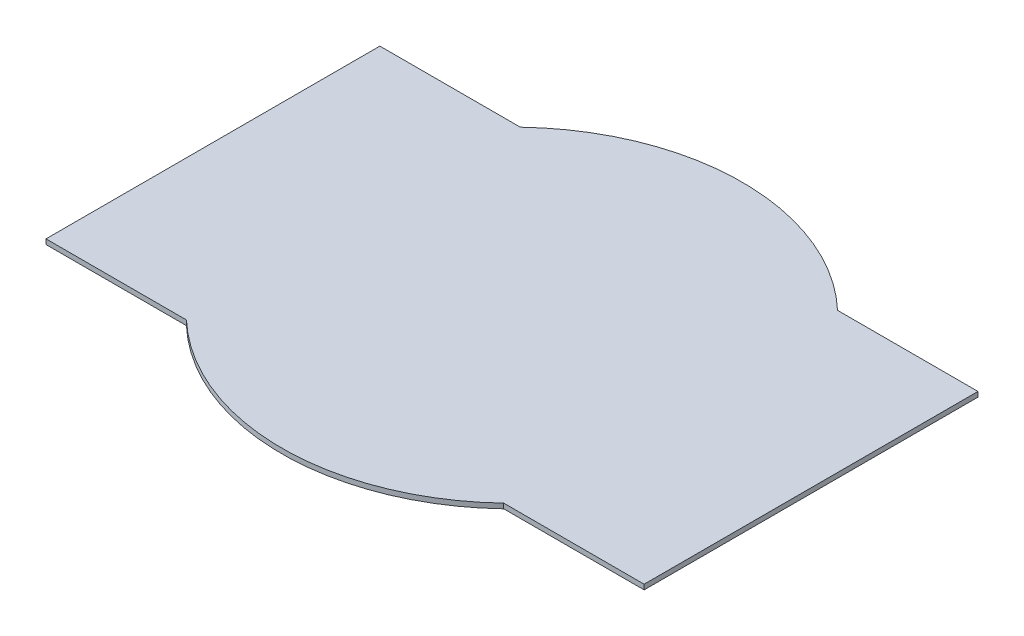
ISO-10303-21;
HEADER;
FILE_DESCRIPTION(('STEP AP214'),'2;1');
FILE_NAME('part.step','',(''),(''),'','','');
FILE_SCHEMA(('AUTOMOTIVE_DESIGN { 1 0 10303 214 1 1 1 1 }'));
ENDSEC;
DATA;
#1=APPLICATION_CONTEXT('core data for automotive mechanical design processes');
#2=APPLICATION_PROTOCOL_DEFINITION('international standard','automotive_design',2000,#1);
#3=PRODUCT_CONTEXT('',#1,'mechanical');
#4=PRODUCT('Part','Part','',(#3));
#5=PRODUCT_RELATED_PRODUCT_CATEGORY('part','',(#4));
#6=PRODUCT_DEFINITION_FORMATION('','',#4);
#7=PRODUCT_DEFINITION_CONTEXT('part definition',#1,'design');
#8=PRODUCT_DEFINITION('design','',#6,#7);
#9=PRODUCT_DEFINITION_SHAPE('','',#8);
#10=(LENGTH_UNIT() NAMED_UNIT(*) SI_UNIT(.MILLI.,.METRE.));
#11=(NAMED_UNIT(*) PLANE_ANGLE_UNIT() SI_UNIT($,.RADIAN.));
#12=(NAMED_UNIT(*) SI_UNIT($,.STERADIAN.) SOLID_ANGLE_UNIT());
#13=UNCERTAINTY_MEASURE_WITH_UNIT(LENGTH_MEASURE(1.E-05),#10,'distance_accuracy_value','');
#14=(GEOMETRIC_REPRESENTATION_CONTEXT(3) GLOBAL_UNCERTAINTY_ASSIGNED_CONTEXT((#13)) GLOBAL_UNIT_ASSIGNED_CONTEXT((#10,
#11,#12)) REPRESENTATION_CONTEXT('',''));
#15=CARTESIAN_POINT('',(0.,0.,0.));
#16=DIRECTION('',(0.,0.,1.));
#17=DIRECTION('',(1.,0.,0.));
#18=AXIS2_PLACEMENT_3D('',#15,#16,#17);
#19=CARTESIAN_POINT('',(-76.545039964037,1.27,-42.7256119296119));
#20=DIRECTION('',(1.,0.,0.));
#21=DIRECTION('',(0.,0.,-1.));
#22=AXIS2_PLACEMENT_3D('',#19,#20,#21);
#23=PLANE('',#22);
#24=DIRECTION('',(0.,0.,1.));
#25=VECTOR('',#24,1.);
#26=CARTESIAN_POINT('',(-76.545039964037,0.,-42.7256119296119));
#27=LINE('',#26,#25);
#28=CARTESIAN_POINT('',(-76.545039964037,0.,-42.7256119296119));
#29=VERTEX_POINT('',#28);
#30=CARTESIAN_POINT('',(-76.545039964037,0.,42.7256119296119));
#31=VERTEX_POINT('',#30);
#32=EDGE_CURVE('E96',#29,#31,#27,.T.);
#33=ORIENTED_EDGE('',*,*,#32,.T.);
#34=DIRECTION('',(0.,-1.,0.));
#35=VECTOR('',#34,1.);
#36=CARTESIAN_POINT('',(-76.545039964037,1.27,42.7256119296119));
#37=LINE('',#36,#35);
#38=CARTESIAN_POINT('',(-76.545039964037,1.27,42.7256119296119));
#39=VERTEX_POINT('',#38);
#40=EDGE_CURVE('E11',#39,#31,#37,.T.);
#41=ORIENTED_EDGE('',*,*,#40,.F.);
#42=DIRECTION('',(0.,0.,1.));
#43=VECTOR('',#42,1.);
#44=CARTESIAN_POINT('',(-76.545039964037,1.27,-42.7256119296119));
#45=LINE('',#44,#43);
#46=CARTESIAN_POINT('',(-76.545039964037,1.27,-42.7256119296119));
#47=VERTEX_POINT('',#46);
#48=EDGE_CURVE('E123',#47,#39,#45,.T.);
#49=ORIENTED_EDGE('',*,*,#48,.F.);
#50=DIRECTION('',(0.,-1.,0.));
#51=VECTOR('',#50,1.);
#52=CARTESIAN_POINT('',(-76.545039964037,1.27,-42.7256119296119));
#53=LINE('',#52,#51);
#54=EDGE_CURVE('E109',#47,#29,#53,.T.);
#55=ORIENTED_EDGE('',*,*,#54,.T.);
#56=EDGE_LOOP('',(#33,#41,#49,#55));
#57=FACE_BOUND('',#56,.T.);
#58=ADVANCED_FACE('F28',(#57),#23,.F.);
#59=CARTESIAN_POINT('',(-76.545039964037,1.27,42.7256119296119));
#60=DIRECTION('',(0.,0.,-1.));
#61=DIRECTION('',(-1.,0.,0.));
#62=AXIS2_PLACEMENT_3D('',#59,#60,#61);
#63=PLANE('',#62);
#64=DIRECTION('',(1.,0.,0.));
#65=VECTOR('',#64,1.);
#66=CARTESIAN_POINT('',(-76.545039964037,0.,42.7256119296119));
#67=LINE('',#66,#65);
#68=CARTESIAN_POINT('',(-40.6037432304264,0.,42.7256119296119));
#69=VERTEX_POINT('',#68);
#70=EDGE_CURVE('E92',#31,#69,#67,.T.);
#71=ORIENTED_EDGE('',*,*,#70,.T.);
#72=DIRECTION('',(0.,-1.,0.));
#73=VECTOR('',#72,1.);
#74=CARTESIAN_POINT('',(-40.6037432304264,1.27,42.7256119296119));
#75=LINE('',#74,#73);
#76=CARTESIAN_POINT('',(-40.6037432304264,1.27,42.7256119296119));
#77=VERTEX_POINT('',#76);
#78=EDGE_CURVE('E35',#77,#69,#75,.T.);
#79=ORIENTED_EDGE('',*,*,#78,.F.);
#80=DIRECTION('',(1.,0.,0.));
#81=VECTOR('',#80,1.);
#82=CARTESIAN_POINT('',(-76.545039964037,1.27,42.7256119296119));
#83=LINE('',#82,#81);
#84=EDGE_CURVE('E105',#39,#77,#83,.T.);
#85=ORIENTED_EDGE('',*,*,#84,.F.);
#86=ORIENTED_EDGE('',*,*,#40,.T.);
#87=EDGE_LOOP('',(#71,#79,#85,#86));
#88=FACE_BOUND('',#87,.T.);
#89=ADVANCED_FACE('F104',(#88),#63,.F.);
#90=CARTESIAN_POINT('',(0.,1.27,0.));
#91=DIRECTION('',(0.,-1.,0.));
#92=DIRECTION('',(0.,0.,-1.));
#93=AXIS2_PLACEMENT_3D('',#90,#91,#92);
#94=CYLINDRICAL_SURFACE('',#93,58.9418516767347);
#95=CARTESIAN_POINT('',(0.,0.,0.));
#96=DIRECTION('',(0.,1.,0.));
#97=DIRECTION('',(0.,0.,1.));
#98=AXIS2_PLACEMENT_3D('',#95,#96,#97);
#99=CIRCLE('',#98,58.9418516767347);
#100=CARTESIAN_POINT('',(40.6037432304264,0.,42.7256119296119));
#101=VERTEX_POINT('',#100);
#102=EDGE_CURVE('E98',#69,#101,#99,.T.);
#103=ORIENTED_EDGE('',*,*,#102,.T.);
#104=DIRECTION('',(0.,-1.,0.));
#105=VECTOR('',#104,1.);
#106=CARTESIAN_POINT('',(40.6037432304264,1.27,42.7256119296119));
#107=LINE('',#106,#105);
#108=CARTESIAN_POINT('',(40.6037432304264,1.27,42.7256119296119));
#109=VERTEX_POINT('',#108);
#110=EDGE_CURVE('E149',#109,#101,#107,.T.);
#111=ORIENTED_EDGE('',*,*,#110,.F.);
#112=CARTESIAN_POINT('',(0.,1.27,0.));
#113=DIRECTION('',(0.,1.,0.));
#114=DIRECTION('',(0.,0.,1.));
#115=AXIS2_PLACEMENT_3D('',#112,#113,#114);
#116=CIRCLE('',#115,58.9418516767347);
#117=EDGE_CURVE('E126',#77,#109,#116,.T.);
#118=ORIENTED_EDGE('',*,*,#117,.F.);
#119=ORIENTED_EDGE('',*,*,#78,.T.);
#120=EDGE_LOOP('',(#103,#111,#118,#119));
#121=FACE_BOUND('',#120,.T.);
#122=ADVANCED_FACE('F153',(#121),#94,.T.);
#123=CARTESIAN_POINT('',(40.6037432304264,1.27,42.7256119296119));
#124=DIRECTION('',(0.,0.,-1.));
#125=DIRECTION('',(-1.,0.,0.));
#126=AXIS2_PLACEMENT_3D('',#123,#124,#125);
#127=PLANE('',#126);
#128=DIRECTION('',(1.,0.,0.));
#129=VECTOR('',#128,1.);
#130=CARTESIAN_POINT('',(40.6037432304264,0.,42.7256119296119));
#131=LINE('',#130,#129);
#132=CARTESIAN_POINT('',(76.545039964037,0.,42.7256119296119));
#133=VERTEX_POINT('',#132);
#134=EDGE_CURVE('E113',#101,#133,#131,.T.);
#135=ORIENTED_EDGE('',*,*,#134,.T.);
#136=DIRECTION('',(0.,-1.,0.));
#137=VECTOR('',#136,1.);
#138=CARTESIAN_POINT('',(76.545039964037,1.27,42.7256119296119));
#139=LINE('',#138,#137);
#140=CARTESIAN_POINT('',(76.545039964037,1.27,42.7256119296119));
#141=VERTEX_POINT('',#140);
#142=EDGE_CURVE('E146',#141,#133,#139,.T.);
#143=ORIENTED_EDGE('',*,*,#142,.F.);
#144=DIRECTION('',(1.,0.,0.));
#145=VECTOR('',#144,1.);
#146=CARTESIAN_POINT('',(40.6037432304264,1.27,42.7256119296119));
#147=LINE('',#146,#145);
#148=EDGE_CURVE('E128',#109,#141,#147,.T.);
#149=ORIENTED_EDGE('',*,*,#148,.F.);
#150=ORIENTED_EDGE('',*,*,#110,.T.);
#151=EDGE_LOOP('',(#135,#143,#149,#150));
#152=FACE_BOUND('',#151,.T.);
#153=ADVANCED_FACE('F161',(#152),#127,.F.);
#154=CARTESIAN_POINT('',(76.545039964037,1.27,-42.7256119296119));
#155=DIRECTION('',(-1.,0.,0.));
#156=DIRECTION('',(0.,0.,1.));
#157=AXIS2_PLACEMENT_3D('',#154,#155,#156);
#158=PLANE('',#157);
#159=DIRECTION('',(0.,0.,-1.));
#160=VECTOR('',#159,1.);
#161=CARTESIAN_POINT('',(76.545039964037,0.,-42.7256119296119));
#162=LINE('',#161,#160);
#163=CARTESIAN_POINT('',(76.545039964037,0.,-42.7256119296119));
#164=VERTEX_POINT('',#163);
#165=EDGE_CURVE('E115',#133,#164,#162,.T.);
#166=ORIENTED_EDGE('',*,*,#165,.T.);
#167=DIRECTION('',(0.,-1.,0.));
#168=VECTOR('',#167,1.);
#169=CARTESIAN_POINT('',(76.545039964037,1.27,-42.7256119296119));
#170=LINE('',#169,#168);
#171=CARTESIAN_POINT('',(76.545039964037,1.27,-42.7256119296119));
#172=VERTEX_POINT('',#171);
#173=EDGE_CURVE('E143',#172,#164,#170,.T.);
#174=ORIENTED_EDGE('',*,*,#173,.F.);
#175=DIRECTION('',(0.,0.,-1.));
#176=VECTOR('',#175,1.);
#177=CARTESIAN_POINT('',(76.545039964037,1.27,-42.7256119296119));
#178=LINE('',#177,#176);
#179=EDGE_CURVE('E130',#141,#172,#178,.T.);
#180=ORIENTED_EDGE('',*,*,#179,.F.);
#181=ORIENTED_EDGE('',*,*,#142,.T.);
#182=EDGE_LOOP('',(#166,#174,#180,#181));
#183=FACE_BOUND('',#182,.T.);
#184=ADVANCED_FACE('F164',(#183),#158,.F.);
#185=CARTESIAN_POINT('',(40.6037432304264,1.27,-42.7256119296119));
#186=DIRECTION('',(0.,0.,1.));
#187=DIRECTION('',(1.,0.,0.));
#188=AXIS2_PLACEMENT_3D('',#185,#186,#187);
#189=PLANE('',#188);
#190=DIRECTION('',(-1.,0.,0.));
#191=VECTOR('',#190,1.);
#192=CARTESIAN_POINT('',(40.6037432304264,0.,-42.7256119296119));
#193=LINE('',#192,#191);
#194=CARTESIAN_POINT('',(40.6037432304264,0.,-42.7256119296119));
#195=VERTEX_POINT('',#194);
#196=EDGE_CURVE('E117',#164,#195,#193,.T.);
#197=ORIENTED_EDGE('',*,*,#196,.T.);
#198=DIRECTION('',(0.,-1.,0.));
#199=VECTOR('',#198,1.);
#200=CARTESIAN_POINT('',(40.6037432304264,1.27,-42.7256119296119));
#201=LINE('',#200,#199);
#202=CARTESIAN_POINT('',(40.6037432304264,1.27,-42.7256119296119));
#203=VERTEX_POINT('',#202);
#204=EDGE_CURVE('E140',#203,#195,#201,.T.);
#205=ORIENTED_EDGE('',*,*,#204,.F.);
#206=DIRECTION('',(-1.,0.,0.));
#207=VECTOR('',#206,1.);
#208=CARTESIAN_POINT('',(40.6037432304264,1.27,-42.7256119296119));
#209=LINE('',#208,#207);
#210=EDGE_CURVE('E132',#172,#203,#209,.T.);
#211=ORIENTED_EDGE('',*,*,#210,.F.);
#212=ORIENTED_EDGE('',*,*,#173,.T.);
#213=EDGE_LOOP('',(#197,#205,#211,#212));
#214=FACE_BOUND('',#213,.T.);
#215=ADVANCED_FACE('F169',(#214),#189,.F.);
#216=CARTESIAN_POINT('',(0.,1.27,0.));
#217=DIRECTION('',(0.,-1.,0.));
#218=DIRECTION('',(0.,0.,-1.));
#219=AXIS2_PLACEMENT_3D('',#216,#217,#218);
#220=CYLINDRICAL_SURFACE('',#219,58.9418516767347);
#221=CARTESIAN_POINT('',(0.,0.,0.));
#222=DIRECTION('',(0.,1.,0.));
#223=DIRECTION('',(0.,0.,1.));
#224=AXIS2_PLACEMENT_3D('',#221,#222,#223);
#225=CIRCLE('',#224,58.9418516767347);
#226=CARTESIAN_POINT('',(-40.6037432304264,0.,-42.7256119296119));
#227=VERTEX_POINT('',#226);
#228=EDGE_CURVE('E119',#195,#227,#225,.T.);
#229=ORIENTED_EDGE('',*,*,#228,.T.);
#230=DIRECTION('',(0.,-1.,0.));
#231=VECTOR('',#230,1.);
#232=CARTESIAN_POINT('',(-40.6037432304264,1.27,-42.7256119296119));
#233=LINE('',#232,#231);
#234=CARTESIAN_POINT('',(-40.6037432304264,1.27,-42.7256119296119));
#235=VERTEX_POINT('',#234);
#236=EDGE_CURVE('E137',#235,#227,#233,.T.);
#237=ORIENTED_EDGE('',*,*,#236,.F.);
#238=CARTESIAN_POINT('',(0.,1.27,0.));
#239=DIRECTION('',(0.,1.,0.));
#240=DIRECTION('',(0.,0.,1.));
#241=AXIS2_PLACEMENT_3D('',#238,#239,#240);
#242=CIRCLE('',#241,58.9418516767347);
#243=EDGE_CURVE('E47',#203,#235,#242,.T.);
#244=ORIENTED_EDGE('',*,*,#243,.F.);
#245=ORIENTED_EDGE('',*,*,#204,.T.);
#246=EDGE_LOOP('',(#229,#237,#244,#245));
#247=FACE_BOUND('',#246,.T.);
#248=ADVANCED_FACE('F172',(#247),#220,.T.);
#249=CARTESIAN_POINT('',(-76.545039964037,1.27,-42.7256119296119));
#250=DIRECTION('',(0.,0.,1.));
#251=DIRECTION('',(1.,0.,0.));
#252=AXIS2_PLACEMENT_3D('',#249,#250,#251);
#253=PLANE('',#252);
#254=DIRECTION('',(-1.,0.,0.));
#255=VECTOR('',#254,1.);
#256=CARTESIAN_POINT('',(-76.545039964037,0.,-42.7256119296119));
#257=LINE('',#256,#255);
#258=EDGE_CURVE('E121',#227,#29,#257,.T.);
#259=ORIENTED_EDGE('',*,*,#258,.T.);
#260=ORIENTED_EDGE('',*,*,#54,.F.);
#261=DIRECTION('',(-1.,0.,0.));
#262=VECTOR('',#261,1.);
#263=CARTESIAN_POINT('',(-76.545039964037,1.27,-42.7256119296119));
#264=LINE('',#263,#262);
#265=EDGE_CURVE('E42',#235,#47,#264,.T.);
#266=ORIENTED_EDGE('',*,*,#265,.F.);
#267=ORIENTED_EDGE('',*,*,#236,.T.);
#268=EDGE_LOOP('',(#259,#260,#266,#267));
#269=FACE_BOUND('',#268,.T.);
#270=ADVANCED_FACE('F174',(#269),#253,.F.);
#271=CARTESIAN_POINT('',(0.,1.27,0.));
#272=DIRECTION('',(0.,1.,0.));
#273=DIRECTION('',(0.,0.,1.));
#274=AXIS2_PLACEMENT_3D('',#271,#272,#273);
#275=PLANE('',#274);
#276=ORIENTED_EDGE('',*,*,#48,.T.);
#277=ORIENTED_EDGE('',*,*,#84,.T.);
#278=ORIENTED_EDGE('',*,*,#117,.T.);
#279=ORIENTED_EDGE('',*,*,#148,.T.);
#280=ORIENTED_EDGE('',*,*,#179,.T.);
#281=ORIENTED_EDGE('',*,*,#210,.T.);
#282=ORIENTED_EDGE('',*,*,#243,.T.);
#283=ORIENTED_EDGE('',*,*,#265,.T.);
#284=EDGE_LOOP('',(#276,#277,#278,#279,#280,#281,#282,#283));
#285=FACE_BOUND('',#284,.T.);
#286=ADVANCED_FACE('F156',(#285),#275,.T.);
#287=CARTESIAN_POINT('',(0.,0.,0.));
#288=DIRECTION('',(0.,1.,0.));
#289=DIRECTION('',(0.,0.,1.));
#290=AXIS2_PLACEMENT_3D('',#287,#288,#289);
#291=PLANE('',#290);
#292=ORIENTED_EDGE('',*,*,#32,.F.);
#293=ORIENTED_EDGE('',*,*,#258,.F.);
#294=ORIENTED_EDGE('',*,*,#228,.F.);
#295=ORIENTED_EDGE('',*,*,#196,.F.);
#296=ORIENTED_EDGE('',*,*,#165,.F.);
#297=ORIENTED_EDGE('',*,*,#134,.F.);
#298=ORIENTED_EDGE('',*,*,#102,.F.);
#299=ORIENTED_EDGE('',*,*,#70,.F.);
#300=EDGE_LOOP('',(#292,#293,#294,#295,#296,#297,#298,#299));
#301=FACE_BOUND('',#300,.T.);
#302=ADVANCED_FACE('F93',(#301),#291,.F.);
#303=CLOSED_SHELL('',(#58,#89,#122,#153,#184,#215,#248,#270,#286,#302));
#304=MANIFOLD_SOLID_BREP('B2',#303);
#305=ADVANCED_BREP_SHAPE_REPRESENTATION('',(#18,#304),#14);
#306=SHAPE_DEFINITION_REPRESENTATION(#9,#305);
ENDSEC;
END-ISO-10303-21;
